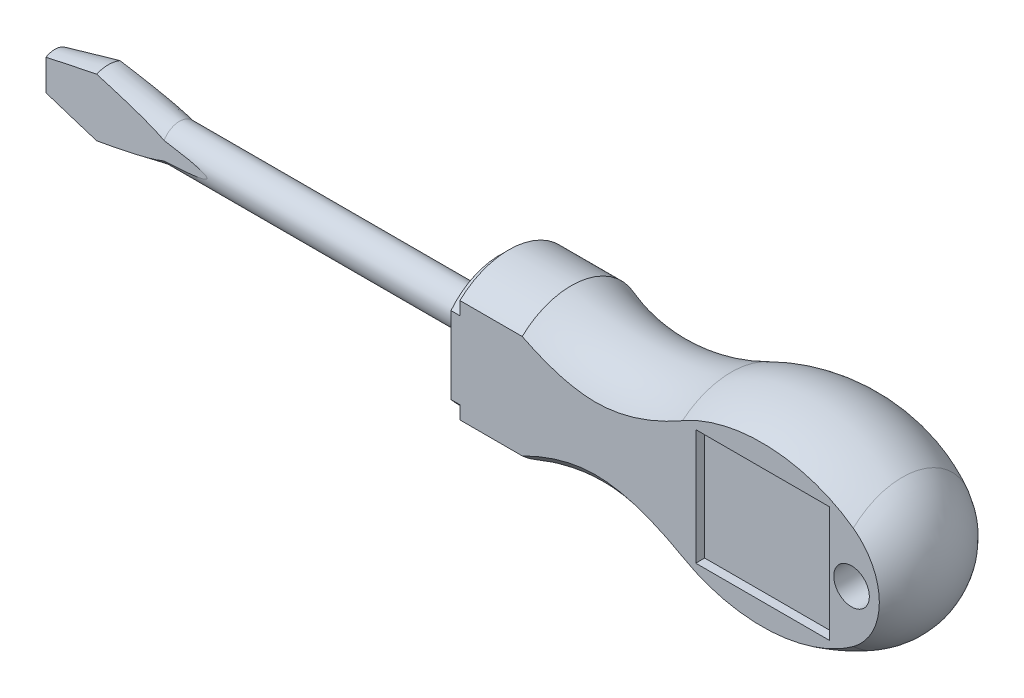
from build123d import *

# Parameters (mm, degrees)
CUT_EXTRUDE_2_DEPTH      = 102.096488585
CUT_EXTRUDE_2_DEPTH_BACK = 102.096488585
SKETCH_8_W               = 50
SKETCH_8_H               = 16
SKETCH_9_R               = 2
CUT_EXTRUDE_3_DEPTH      = 102.814782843
CUT_EXTRUDE_5_DEPTH      = 102.096488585
CUT_EXTRUDE_5_DEPTH_BACK = 102.096488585
SKETCH_12_W              = 15
SKETCH_12_H              = 13
CUT_EXTRUDE_6_DEPTH      = 1


with BuildPart() as part:
    # Sketch 1 → Revolve 1 (revolve)
    with BuildSketch(Plane.XY):
        with BuildLine():
            Line((-42, 8), (-49, 8))
            Line((-49, 8), (-49, 7))
            Line((-49, 7), (-50, 7))
            Line((-50, 7), (-50, 2))
            Line((-50, 2), (-86, 2))
            Line((-86, 2), (-94, 3.5))
            Line((-94, 3.5), (-100, 2))
            Line((-100, 2), (-100, 0))
            Line((-100, 0), (0, 0))
            ThreePointArc((0, 0), (-1.293767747, 4.649084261), (-4.803107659, 7.961538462))
            ThreePointArc((-4.803107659, 7.961538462), (-14.326332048, 10.487690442), (-23.997141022, 8.603890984))
            ThreePointArc((-23.997141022, 8.603890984), (-32.939766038, 6.548899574), (-42, 8))
        make_face()
    revolve(axis=Axis((-100, 0, 0), (-1, 0, 0)))

    # Sketch 8 → Cut-Extrude 2 (cut, two sides: drawn at the far end of the back side and taken through both)
    with BuildSketch(Plane(origin=(0, 0, 0), x_dir=(1, 0, 0), z_dir=(0, 1, 0)).offset(-CUT_EXTRUDE_2_DEPTH_BACK)):
        with Locations((-25, -13.5)):
            Rectangle(SKETCH_8_W, SKETCH_8_H)
    extrude(amount=CUT_EXTRUDE_2_DEPTH + CUT_EXTRUDE_2_DEPTH_BACK, mode=Mode.SUBTRACT)

    # Sketch 9 → Cut-Extrude 3 (cut, through all)
    with BuildSketch(Plane.XY.offset(5.5)):
        with Locations((-5, 0)):
            Circle(SKETCH_9_R)
    extrude(amount=-CUT_EXTRUDE_3_DEPTH, mode=Mode.SUBTRACT)

    # Sketch 11 → Cut-Extrude 5 (cut, two sides: drawn at the far end of the back side and taken through both)
    with BuildSketch(Plane(origin=(0, 0, 0), x_dir=(1, 0, 0), z_dir=(0, 1, 0)).offset(-CUT_EXTRUDE_5_DEPTH_BACK)):
        Polygon((-100, 1), (-80.918863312, 2), (-80.918863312, 8), (-100, 8), align=None)
        Polygon((-100, -8), (-100, -1), (-80.918863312, -2), (-80.918863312, -8), align=None)
    extrude(amount=CUT_EXTRUDE_5_DEPTH + CUT_EXTRUDE_5_DEPTH_BACK, mode=Mode.SUBTRACT)

    # Sketch 12 → Cut-Extrude 6 (cut)
    with BuildSketch(Plane.XY.offset(5.5)):
        with Locations((-15, 0)):
            Rectangle(SKETCH_12_W, SKETCH_12_H)
    extrude(amount=-CUT_EXTRUDE_6_DEPTH, mode=Mode.SUBTRACT)


solid = part.part
